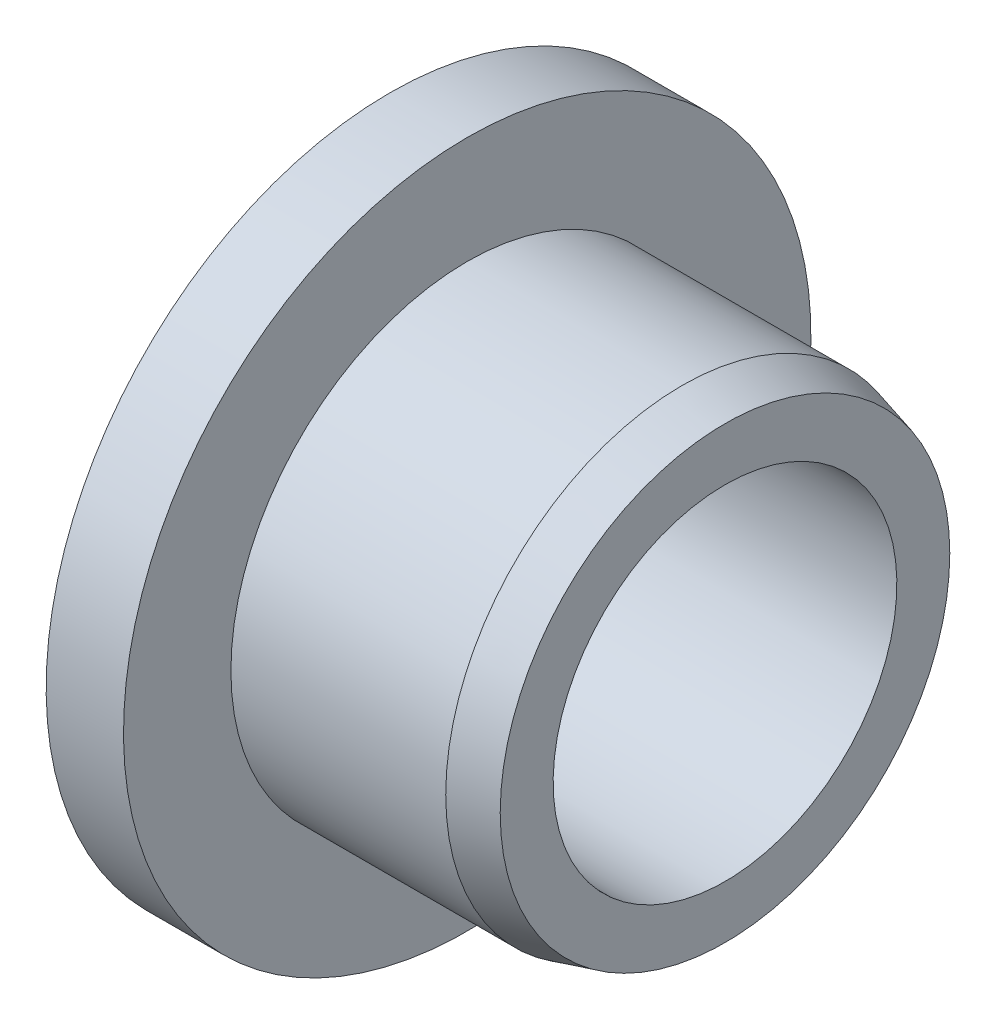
ISO-10303-21;
HEADER;
FILE_DESCRIPTION(('STEP AP214'),'2;1');
FILE_NAME('part.step','',(''),(''),'','','');
FILE_SCHEMA(('AUTOMOTIVE_DESIGN { 1 0 10303 214 1 1 1 1 }'));
ENDSEC;
DATA;
#1=APPLICATION_CONTEXT('core data for automotive mechanical design processes');
#2=APPLICATION_PROTOCOL_DEFINITION('international standard','automotive_design',2000,#1);
#3=PRODUCT_CONTEXT('',#1,'mechanical');
#4=PRODUCT('Part','Part','',(#3));
#5=PRODUCT_RELATED_PRODUCT_CATEGORY('part','',(#4));
#6=PRODUCT_DEFINITION_FORMATION('','',#4);
#7=PRODUCT_DEFINITION_CONTEXT('part definition',#1,'design');
#8=PRODUCT_DEFINITION('design','',#6,#7);
#9=PRODUCT_DEFINITION_SHAPE('','',#8);
#10=(LENGTH_UNIT() NAMED_UNIT(*) SI_UNIT(.MILLI.,.METRE.));
#11=(NAMED_UNIT(*) PLANE_ANGLE_UNIT() SI_UNIT($,.RADIAN.));
#12=(NAMED_UNIT(*) SI_UNIT($,.STERADIAN.) SOLID_ANGLE_UNIT());
#13=UNCERTAINTY_MEASURE_WITH_UNIT(LENGTH_MEASURE(1.E-05),#10,'distance_accuracy_value','');
#14=(GEOMETRIC_REPRESENTATION_CONTEXT(3) GLOBAL_UNCERTAINTY_ASSIGNED_CONTEXT((#13)) GLOBAL_UNIT_ASSIGNED_CONTEXT((#10,
#11,#12)) REPRESENTATION_CONTEXT('',''));
#15=CARTESIAN_POINT('',(0.,0.,0.));
#16=DIRECTION('',(0.,0.,1.));
#17=DIRECTION('',(1.,0.,0.));
#18=AXIS2_PLACEMENT_3D('',#15,#16,#17);
#19=CARTESIAN_POINT('',(6.79999999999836,0.,0.));
#20=DIRECTION('',(-1.,0.,0.));
#21=DIRECTION('',(0.,0.,1.));
#22=AXIS2_PLACEMENT_3D('',#19,#20,#21);
#23=CONICAL_SURFACE('',#22,5.50000000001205,0.261799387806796);
#24=CARTESIAN_POINT('',(6.79999999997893,0.,0.));
#25=DIRECTION('',(1.,0.,0.));
#26=DIRECTION('',(0.,1.,0.));
#27=AXIS2_PLACEMENT_3D('',#24,#25,#26);
#28=CIRCLE('',#27,5.5);
#29=CARTESIAN_POINT('',(6.79999999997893,5.5,0.));
#30=VERTEX_POINT('',#29);
#31=EDGE_CURVE('E29',#30,#30,#28,.F.);
#32=ORIENTED_EDGE('',*,*,#31,.F.);
#33=EDGE_LOOP('',(#32));
#34=FACE_BOUND('',#33,.T.);
#35=CARTESIAN_POINT('',(7.80000000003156,0.,0.));
#36=DIRECTION('',(-1.,0.,0.));
#37=DIRECTION('',(0.,0.,1.));
#38=AXIS2_PLACEMENT_3D('',#35,#36,#37);
#39=CIRCLE('',#38,5.23205080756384);
#40=CARTESIAN_POINT('',(7.80000000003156,0.,5.23205080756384));
#41=VERTEX_POINT('',#40);
#42=EDGE_CURVE('E17',#41,#41,#39,.F.);
#43=ORIENTED_EDGE('',*,*,#42,.F.);
#44=EDGE_LOOP('',(#43));
#45=FACE_BOUND('',#44,.T.);
#46=ADVANCED_FACE('F14',(#34,#45),#23,.T.);
#47=CARTESIAN_POINT('',(-0.390000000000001,0.,0.));
#48=DIRECTION('',(1.,0.,0.));
#49=DIRECTION('',(0.,1.,0.));
#50=AXIS2_PLACEMENT_3D('',#47,#48,#49);
#51=CYLINDRICAL_SURFACE('',#50,5.5);
#52=ORIENTED_EDGE('',*,*,#31,.T.);
#53=EDGE_LOOP('',(#52));
#54=FACE_BOUND('',#53,.T.);
#55=CARTESIAN_POINT('',(1.80000000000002,0.,0.));
#56=DIRECTION('',(1.,0.,0.));
#57=DIRECTION('',(0.,1.,0.));
#58=AXIS2_PLACEMENT_3D('',#55,#56,#57);
#59=CIRCLE('',#58,5.5);
#60=CARTESIAN_POINT('',(1.80000000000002,5.5,0.));
#61=VERTEX_POINT('',#60);
#62=EDGE_CURVE('E35',#61,#61,#59,.F.);
#63=ORIENTED_EDGE('',*,*,#62,.F.);
#64=EDGE_LOOP('',(#63));
#65=FACE_BOUND('',#64,.T.);
#66=ADVANCED_FACE('F45',(#54,#65),#51,.T.);
#67=CARTESIAN_POINT('',(7.79999999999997,0.,0.));
#68=DIRECTION('',(1.,0.,0.));
#69=DIRECTION('',(0.,1.,0.));
#70=AXIS2_PLACEMENT_3D('',#67,#68,#69);
#71=PLANE('',#70);
#72=ORIENTED_EDGE('',*,*,#42,.T.);
#73=EDGE_LOOP('',(#72));
#74=FACE_BOUND('',#73,.T.);
#75=CARTESIAN_POINT('',(7.79999999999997,0.,0.));
#76=DIRECTION('',(1.,0.,0.));
#77=DIRECTION('',(0.,1.,0.));
#78=AXIS2_PLACEMENT_3D('',#75,#76,#77);
#79=CIRCLE('',#78,4.);
#80=CARTESIAN_POINT('',(7.79999999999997,4.,0.));
#81=VERTEX_POINT('',#80);
#82=EDGE_CURVE('E33',#81,#81,#79,.F.);
#83=ORIENTED_EDGE('',*,*,#82,.T.);
#84=EDGE_LOOP('',(#83));
#85=FACE_BOUND('',#84,.T.);
#86=ADVANCED_FACE('F54',(#74,#85),#71,.T.);
#87=CARTESIAN_POINT('',(1.80000000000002,0.,0.));
#88=DIRECTION('',(1.,0.,0.));
#89=DIRECTION('',(0.,1.,0.));
#90=AXIS2_PLACEMENT_3D('',#87,#88,#89);
#91=PLANE('',#90);
#92=CARTESIAN_POINT('',(1.80000000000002,0.,0.));
#93=DIRECTION('',(1.,0.,0.));
#94=DIRECTION('',(0.,1.,0.));
#95=AXIS2_PLACEMENT_3D('',#92,#93,#94);
#96=CIRCLE('',#95,8.);
#97=CARTESIAN_POINT('',(1.80000000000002,8.,0.));
#98=VERTEX_POINT('',#97);
#99=EDGE_CURVE('E26',#98,#98,#96,.F.);
#100=ORIENTED_EDGE('',*,*,#99,.F.);
#101=EDGE_LOOP('',(#100));
#102=FACE_BOUND('',#101,.T.);
#103=ORIENTED_EDGE('',*,*,#62,.T.);
#104=EDGE_LOOP('',(#103));
#105=FACE_BOUND('',#104,.T.);
#106=ADVANCED_FACE('F70',(#102,#105),#91,.T.);
#107=CARTESIAN_POINT('',(-0.390000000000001,0.,0.));
#108=DIRECTION('',(1.,0.,0.));
#109=DIRECTION('',(0.,1.,0.));
#110=AXIS2_PLACEMENT_3D('',#107,#108,#109);
#111=CYLINDRICAL_SURFACE('',#110,4.);
#112=ORIENTED_EDGE('',*,*,#82,.F.);
#113=EDGE_LOOP('',(#112));
#114=FACE_BOUND('',#113,.T.);
#115=CARTESIAN_POINT('',(0.,0.,0.));
#116=DIRECTION('',(1.,0.,0.));
#117=DIRECTION('',(0.,1.,0.));
#118=AXIS2_PLACEMENT_3D('',#115,#116,#117);
#119=CIRCLE('',#118,4.);
#120=CARTESIAN_POINT('',(0.,4.,0.));
#121=VERTEX_POINT('',#120);
#122=EDGE_CURVE('E21',#121,#121,#119,.F.);
#123=ORIENTED_EDGE('',*,*,#122,.T.);
#124=EDGE_LOOP('',(#123));
#125=FACE_BOUND('',#124,.T.);
#126=ADVANCED_FACE('F63',(#114,#125),#111,.F.);
#127=CARTESIAN_POINT('',(-0.390000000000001,0.,0.));
#128=DIRECTION('',(1.,0.,0.));
#129=DIRECTION('',(0.,1.,0.));
#130=AXIS2_PLACEMENT_3D('',#127,#128,#129);
#131=CYLINDRICAL_SURFACE('',#130,8.);
#132=ORIENTED_EDGE('',*,*,#99,.T.);
#133=EDGE_LOOP('',(#132));
#134=FACE_BOUND('',#133,.T.);
#135=CARTESIAN_POINT('',(0.,0.,0.));
#136=DIRECTION('',(1.,0.,0.));
#137=DIRECTION('',(0.,1.,0.));
#138=AXIS2_PLACEMENT_3D('',#135,#136,#137);
#139=CIRCLE('',#138,8.);
#140=CARTESIAN_POINT('',(0.,8.,0.));
#141=VERTEX_POINT('',#140);
#142=EDGE_CURVE('E10',#141,#141,#139,.T.);
#143=ORIENTED_EDGE('',*,*,#142,.T.);
#144=EDGE_LOOP('',(#143));
#145=FACE_BOUND('',#144,.T.);
#146=ADVANCED_FACE('F57',(#134,#145),#131,.T.);
#147=CARTESIAN_POINT('',(0.,0.,0.));
#148=DIRECTION('',(1.,0.,0.));
#149=DIRECTION('',(0.,1.,0.));
#150=AXIS2_PLACEMENT_3D('',#147,#148,#149);
#151=PLANE('',#150);
#152=ORIENTED_EDGE('',*,*,#142,.F.);
#153=EDGE_LOOP('',(#152));
#154=FACE_BOUND('',#153,.T.);
#155=ORIENTED_EDGE('',*,*,#122,.F.);
#156=EDGE_LOOP('',(#155));
#157=FACE_BOUND('',#156,.T.);
#158=ADVANCED_FACE('F55',(#154,#157),#151,.F.);
#159=CLOSED_SHELL('',(#46,#66,#86,#106,#126,#146,#158));
#160=MANIFOLD_SOLID_BREP('B1',#159);
#161=ADVANCED_BREP_SHAPE_REPRESENTATION('',(#18,#160),#14);
#162=SHAPE_DEFINITION_REPRESENTATION(#9,#161);
ENDSEC;
END-ISO-10303-21;
